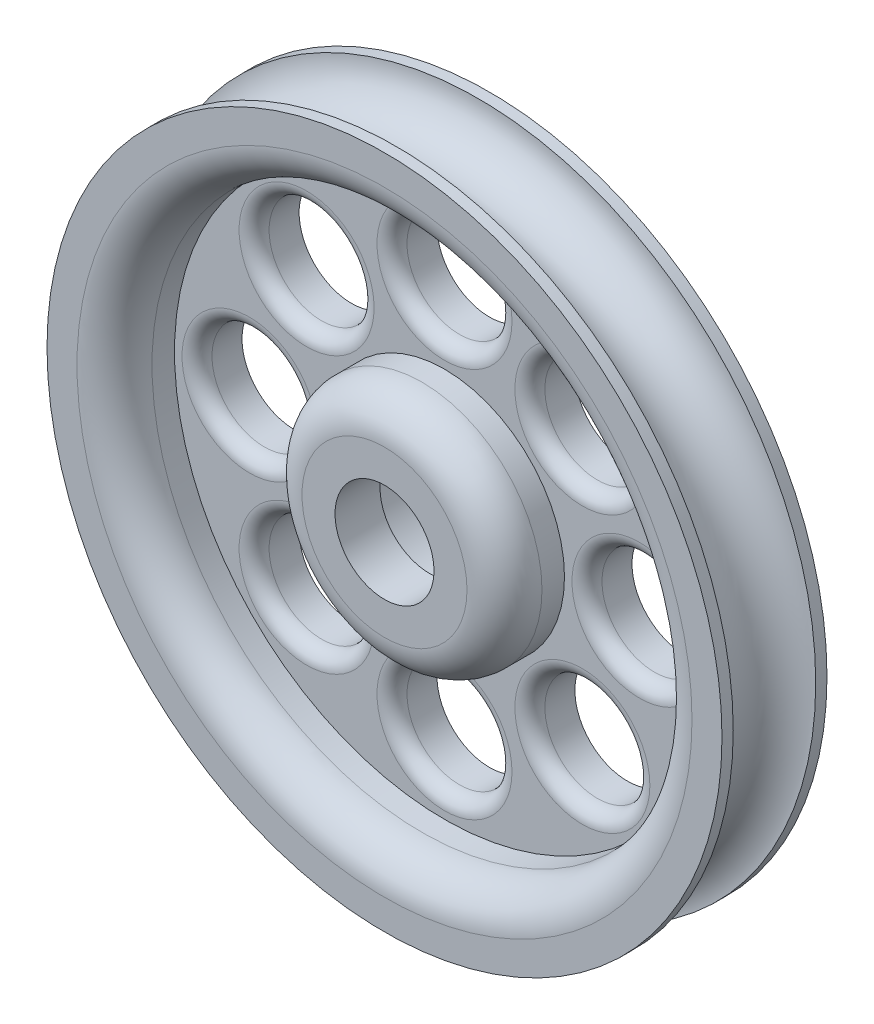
ISO-10303-21;
HEADER;
FILE_DESCRIPTION(('STEP AP214'),'2;1');
FILE_NAME('part.step','',(''),(''),'','','');
FILE_SCHEMA(('AUTOMOTIVE_DESIGN { 1 0 10303 214 1 1 1 1 }'));
ENDSEC;
DATA;
#1=APPLICATION_CONTEXT('core data for automotive mechanical design processes');
#2=APPLICATION_PROTOCOL_DEFINITION('international standard','automotive_design',2000,#1);
#3=PRODUCT_CONTEXT('',#1,'mechanical');
#4=PRODUCT('Part','Part','',(#3));
#5=PRODUCT_RELATED_PRODUCT_CATEGORY('part','',(#4));
#6=PRODUCT_DEFINITION_FORMATION('','',#4);
#7=PRODUCT_DEFINITION_CONTEXT('part definition',#1,'design');
#8=PRODUCT_DEFINITION('design','',#6,#7);
#9=PRODUCT_DEFINITION_SHAPE('','',#8);
#10=(LENGTH_UNIT() NAMED_UNIT(*) SI_UNIT(.MILLI.,.METRE.));
#11=(NAMED_UNIT(*) PLANE_ANGLE_UNIT() SI_UNIT($,.RADIAN.));
#12=(NAMED_UNIT(*) SI_UNIT($,.STERADIAN.) SOLID_ANGLE_UNIT());
#13=UNCERTAINTY_MEASURE_WITH_UNIT(LENGTH_MEASURE(1.E-05),#10,'distance_accuracy_value','');
#14=(GEOMETRIC_REPRESENTATION_CONTEXT(3) GLOBAL_UNCERTAINTY_ASSIGNED_CONTEXT((#13)) GLOBAL_UNIT_ASSIGNED_CONTEXT((#10,
#11,#12)) REPRESENTATION_CONTEXT('',''));
#15=CARTESIAN_POINT('',(0.,0.,0.));
#16=DIRECTION('',(0.,0.,1.));
#17=DIRECTION('',(1.,0.,0.));
#18=AXIS2_PLACEMENT_3D('',#15,#16,#17);
#19=CARTESIAN_POINT('',(0.,0.,7.));
#20=DIRECTION('',(0.,0.,-1.));
#21=DIRECTION('',(-1.,0.,0.));
#22=AXIS2_PLACEMENT_3D('',#19,#20,#21);
#23=CYLINDRICAL_SURFACE('',#22,22.5);
#24=CARTESIAN_POINT('',(0.,0.,0.750000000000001));
#25=DIRECTION('',(0.,0.,1.));
#26=DIRECTION('',(1.,0.,0.));
#27=AXIS2_PLACEMENT_3D('',#24,#25,#26);
#28=CIRCLE('',#27,22.5);
#29=CARTESIAN_POINT('',(22.5,0.,0.750000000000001));
#30=VERTEX_POINT('',#29);
#31=EDGE_CURVE('E99',#30,#30,#28,.F.);
#32=ORIENTED_EDGE('',*,*,#31,.T.);
#33=EDGE_LOOP('',(#32));
#34=FACE_BOUND('',#33,.T.);
#35=CARTESIAN_POINT('',(0.,0.,0.));
#36=DIRECTION('',(0.,0.,1.));
#37=DIRECTION('',(1.,0.,0.));
#38=AXIS2_PLACEMENT_3D('',#35,#36,#37);
#39=CIRCLE('',#38,22.5);
#40=CARTESIAN_POINT('',(22.5,0.,0.));
#41=VERTEX_POINT('',#40);
#42=EDGE_CURVE('E102',#41,#41,#39,.T.);
#43=ORIENTED_EDGE('',*,*,#42,.T.);
#44=EDGE_LOOP('',(#43));
#45=FACE_BOUND('',#44,.T.);
#46=ADVANCED_FACE('F30',(#34,#45),#23,.T.);
#47=CARTESIAN_POINT('',(0.,0.,0.));
#48=DIRECTION('',(0.,0.,1.));
#49=DIRECTION('',(1.,0.,0.));
#50=AXIS2_PLACEMENT_3D('',#47,#48,#49);
#51=PLANE('',#50);
#52=CARTESIAN_POINT('',(0.,0.,0.));
#53=DIRECTION('',(0.,0.,-1.));
#54=DIRECTION('',(-1.,0.,0.));
#55=AXIS2_PLACEMENT_3D('',#52,#53,#54);
#56=CIRCLE('',#55,4.95);
#57=CARTESIAN_POINT('',(-4.95,0.,0.));
#58=VERTEX_POINT('',#57);
#59=EDGE_CURVE('E141',#58,#58,#56,.T.);
#60=ORIENTED_EDGE('',*,*,#59,.F.);
#61=EDGE_LOOP('',(#60));
#62=FACE_BOUND('',#61,.T.);
#63=CARTESIAN_POINT('',(-9.1923881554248,9.19238815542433,0.));
#64=DIRECTION('',(0.,0.,1.));
#65=DIRECTION('',(1.,0.,0.));
#66=AXIS2_PLACEMENT_3D('',#63,#64,#65);
#67=CIRCLE('',#66,3.5000000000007);
#68=CARTESIAN_POINT('',(-5.6923881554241,9.19238815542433,0.));
#69=VERTEX_POINT('',#68);
#70=EDGE_CURVE('E137',#69,#69,#67,.T.);
#71=ORIENTED_EDGE('',*,*,#70,.T.);
#72=EDGE_LOOP('',(#71));
#73=FACE_BOUND('',#72,.T.);
#74=CARTESIAN_POINT('',(-12.9999999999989,-1.10844666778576E-12,0.));
#75=DIRECTION('',(0.,0.,1.));
#76=DIRECTION('',(1.,0.,0.));
#77=AXIS2_PLACEMENT_3D('',#74,#75,#76);
#78=CIRCLE('',#77,3.50000000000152);
#79=CARTESIAN_POINT('',(-9.49999999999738,-1.10844666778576E-12,0.));
#80=VERTEX_POINT('',#79);
#81=EDGE_CURVE('E134',#80,#80,#78,.T.);
#82=ORIENTED_EDGE('',*,*,#81,.T.);
#83=EDGE_LOOP('',(#82));
#84=FACE_BOUND('',#83,.T.);
#85=CARTESIAN_POINT('',(-9.19238815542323,-9.1923881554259,0.));
#86=DIRECTION('',(0.,0.,1.));
#87=DIRECTION('',(1.,0.,0.));
#88=AXIS2_PLACEMENT_3D('',#85,#86,#87);
#89=CIRCLE('',#88,3.50000000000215);
#90=CARTESIAN_POINT('',(-5.69238815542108,-9.1923881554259,0.));
#91=VERTEX_POINT('',#90);
#92=EDGE_CURVE('E131',#91,#91,#89,.T.);
#93=ORIENTED_EDGE('',*,*,#92,.T.);
#94=EDGE_LOOP('',(#93));
#95=FACE_BOUND('',#94,.T.);
#96=CARTESIAN_POINT('',(2.21370925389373E-12,-13.,0.));
#97=DIRECTION('',(0.,0.,1.));
#98=DIRECTION('',(1.,0.,0.));
#99=AXIS2_PLACEMENT_3D('',#96,#97,#98);
#100=CIRCLE('',#99,3.50000000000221);
#101=CARTESIAN_POINT('',(3.50000000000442,-13.,0.));
#102=VERTEX_POINT('',#101);
#103=EDGE_CURVE('E128',#102,#102,#100,.T.);
#104=ORIENTED_EDGE('',*,*,#103,.T.);
#105=EDGE_LOOP('',(#104));
#106=FACE_BOUND('',#105,.T.);
#107=CARTESIAN_POINT('',(9.19238815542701,-9.19238815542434,0.));
#108=DIRECTION('',(0.,0.,1.));
#109=DIRECTION('',(1.,0.,0.));
#110=AXIS2_PLACEMENT_3D('',#107,#108,#109);
#111=CIRCLE('',#110,3.50000000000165);
#112=CARTESIAN_POINT('',(12.6923881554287,-9.19238815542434,0.));
#113=VERTEX_POINT('',#112);
#114=EDGE_CURVE('E125',#113,#113,#111,.T.);
#115=ORIENTED_EDGE('',*,*,#114,.T.);
#116=EDGE_LOOP('',(#115));
#117=FACE_BOUND('',#116,.T.);
#118=CARTESIAN_POINT('',(13.0000000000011,1.10685462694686E-12,0.));
#119=DIRECTION('',(0.,0.,1.));
#120=DIRECTION('',(1.,0.,0.));
#121=AXIS2_PLACEMENT_3D('',#118,#119,#120);
#122=CIRCLE('',#121,3.50000000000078);
#123=CARTESIAN_POINT('',(16.5000000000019,1.10685462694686E-12,0.));
#124=VERTEX_POINT('',#123);
#125=EDGE_CURVE('E122',#124,#124,#122,.T.);
#126=ORIENTED_EDGE('',*,*,#125,.T.);
#127=EDGE_LOOP('',(#126));
#128=FACE_BOUND('',#127,.T.);
#129=CARTESIAN_POINT('',(9.19238815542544,9.1923881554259,0.));
#130=DIRECTION('',(0.,0.,1.));
#131=DIRECTION('',(1.,0.,0.));
#132=AXIS2_PLACEMENT_3D('',#129,#130,#131);
#133=CIRCLE('',#132,3.50000000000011);
#134=CARTESIAN_POINT('',(12.6923881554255,9.1923881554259,0.));
#135=VERTEX_POINT('',#134);
#136=EDGE_CURVE('E119',#135,#135,#133,.T.);
#137=ORIENTED_EDGE('',*,*,#136,.T.);
#138=EDGE_LOOP('',(#137));
#139=FACE_BOUND('',#138,.T.);
#140=CARTESIAN_POINT('',(0.,13.,0.));
#141=DIRECTION('',(0.,0.,1.));
#142=DIRECTION('',(1.,0.,0.));
#143=AXIS2_PLACEMENT_3D('',#140,#141,#142);
#144=CIRCLE('',#143,3.5);
#145=CARTESIAN_POINT('',(3.5,13.,0.));
#146=VERTEX_POINT('',#145);
#147=EDGE_CURVE('E116',#146,#146,#144,.T.);
#148=ORIENTED_EDGE('',*,*,#147,.T.);
#149=EDGE_LOOP('',(#148));
#150=FACE_BOUND('',#149,.T.);
#151=ORIENTED_EDGE('',*,*,#42,.F.);
#152=EDGE_LOOP('',(#151));
#153=FACE_BOUND('',#152,.T.);
#154=ADVANCED_FACE('F174',(#62,#73,#84,#95,#106,#117,#128,#139,#150,#153),#51,.F.);
#155=CARTESIAN_POINT('',(0.,0.,3.5));
#156=DIRECTION('',(0.,0.,-1.));
#157=DIRECTION('',(-1.,0.,0.));
#158=AXIS2_PLACEMENT_3D('',#155,#156,#157);
#159=TOROIDAL_SURFACE('',#158,22.5,2.75);
#160=CARTESIAN_POINT('',(0.,0.,6.25));
#161=DIRECTION('',(0.,0.,-1.));
#162=DIRECTION('',(-1.,0.,0.));
#163=AXIS2_PLACEMENT_3D('',#160,#161,#162);
#164=CIRCLE('',#163,22.5);
#165=CARTESIAN_POINT('',(-22.5,0.,6.25));
#166=VERTEX_POINT('',#165);
#167=EDGE_CURVE('E103',#166,#166,#164,.F.);
#168=ORIENTED_EDGE('',*,*,#167,.F.);
#169=EDGE_LOOP('',(#168));
#170=FACE_BOUND('',#169,.T.);
#171=ORIENTED_EDGE('',*,*,#31,.F.);
#172=EDGE_LOOP('',(#171));
#173=FACE_BOUND('',#172,.T.);
#174=ADVANCED_FACE('F177',(#170,#173),#159,.F.);
#175=CARTESIAN_POINT('',(0.,0.,7.));
#176=DIRECTION('',(0.,0.,1.));
#177=DIRECTION('',(1.,0.,0.));
#178=AXIS2_PLACEMENT_3D('',#175,#176,#177);
#179=PLANE('',#178);
#180=CARTESIAN_POINT('',(0.,0.,7.));
#181=DIRECTION('',(0.,0.,1.));
#182=DIRECTION('',(1.,0.,0.));
#183=AXIS2_PLACEMENT_3D('',#180,#181,#182);
#184=CIRCLE('',#183,20.5);
#185=CARTESIAN_POINT('',(20.5,0.,7.));
#186=VERTEX_POINT('',#185);
#187=EDGE_CURVE('E86',#186,#186,#184,.F.);
#188=ORIENTED_EDGE('',*,*,#187,.T.);
#189=EDGE_LOOP('',(#188));
#190=FACE_BOUND('',#189,.T.);
#191=CARTESIAN_POINT('',(0.,0.,7.));
#192=DIRECTION('',(0.,0.,1.));
#193=DIRECTION('',(1.,0.,0.));
#194=AXIS2_PLACEMENT_3D('',#191,#192,#193);
#195=CIRCLE('',#194,22.5);
#196=CARTESIAN_POINT('',(22.5,0.,7.));
#197=VERTEX_POINT('',#196);
#198=EDGE_CURVE('E98',#197,#197,#195,.T.);
#199=ORIENTED_EDGE('',*,*,#198,.T.);
#200=EDGE_LOOP('',(#199));
#201=FACE_BOUND('',#200,.T.);
#202=ADVANCED_FACE('F206',(#190,#201),#179,.T.);
#203=ORIENTED_EDGE('',*,*,#167,.T.);
#204=EDGE_LOOP('',(#203));
#205=FACE_BOUND('',#204,.T.);
#206=ORIENTED_EDGE('',*,*,#198,.F.);
#207=EDGE_LOOP('',(#206));
#208=FACE_BOUND('',#207,.T.);
#209=ADVANCED_FACE('F200',(#205,#208),#23,.T.);
#210=CARTESIAN_POINT('',(0.,0.,3.));
#211=DIRECTION('',(0.,0.,1.));
#212=DIRECTION('',(1.,0.,0.));
#213=AXIS2_PLACEMENT_3D('',#210,#211,#212);
#214=CYLINDRICAL_SURFACE('',#213,18.);
#215=CARTESIAN_POINT('',(0.,0.,4.5));
#216=DIRECTION('',(0.,0.,1.));
#217=DIRECTION('',(1.,0.,0.));
#218=AXIS2_PLACEMENT_3D('',#215,#216,#217);
#219=CIRCLE('',#218,18.);
#220=CARTESIAN_POINT('',(18.,0.,4.5));
#221=VERTEX_POINT('',#220);
#222=EDGE_CURVE('E89',#221,#221,#219,.T.);
#223=ORIENTED_EDGE('',*,*,#222,.T.);
#224=EDGE_LOOP('',(#223));
#225=FACE_BOUND('',#224,.T.);
#226=CARTESIAN_POINT('',(0.,0.,3.));
#227=DIRECTION('',(0.,0.,1.));
#228=DIRECTION('',(1.,0.,0.));
#229=AXIS2_PLACEMENT_3D('',#226,#227,#228);
#230=CIRCLE('',#229,18.);
#231=CARTESIAN_POINT('',(18.,0.,3.));
#232=VERTEX_POINT('',#231);
#233=EDGE_CURVE('E106',#232,#232,#230,.T.);
#234=ORIENTED_EDGE('',*,*,#233,.F.);
#235=EDGE_LOOP('',(#234));
#236=FACE_BOUND('',#235,.T.);
#237=ADVANCED_FACE('F205',(#225,#236),#214,.F.);
#238=CARTESIAN_POINT('',(0.,0.,3.));
#239=DIRECTION('',(0.,0.,1.));
#240=DIRECTION('',(1.,0.,0.));
#241=AXIS2_PLACEMENT_3D('',#238,#239,#240);
#242=PLANE('',#241);
#243=CARTESIAN_POINT('',(0.,13.,3.));
#244=DIRECTION('',(0.,0.,1.));
#245=DIRECTION('',(1.,0.,0.));
#246=AXIS2_PLACEMENT_3D('',#243,#244,#245);
#247=CIRCLE('',#246,4.5);
#248=CARTESIAN_POINT('',(4.5,13.,3.));
#249=VERTEX_POINT('',#248);
#250=EDGE_CURVE('E59',#249,#249,#247,.F.);
#251=ORIENTED_EDGE('',*,*,#250,.T.);
#252=EDGE_LOOP('',(#251));
#253=FACE_BOUND('',#252,.T.);
#254=CARTESIAN_POINT('',(-9.1923881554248,9.19238815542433,3.));
#255=DIRECTION('',(0.,0.,1.));
#256=DIRECTION('',(1.,0.,0.));
#257=AXIS2_PLACEMENT_3D('',#254,#255,#256);
#258=CIRCLE('',#257,4.5000000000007);
#259=CARTESIAN_POINT('',(-4.6923881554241,9.19238815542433,3.));
#260=VERTEX_POINT('',#259);
#261=EDGE_CURVE('E62',#260,#260,#258,.F.);
#262=ORIENTED_EDGE('',*,*,#261,.T.);
#263=EDGE_LOOP('',(#262));
#264=FACE_BOUND('',#263,.T.);
#265=CARTESIAN_POINT('',(-9.19238815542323,-9.1923881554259,3.));
#266=DIRECTION('',(0.,0.,1.));
#267=DIRECTION('',(1.,0.,0.));
#268=AXIS2_PLACEMENT_3D('',#265,#266,#267);
#269=CIRCLE('',#268,4.50000000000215);
#270=CARTESIAN_POINT('',(-4.69238815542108,-9.1923881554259,3.));
#271=VERTEX_POINT('',#270);
#272=EDGE_CURVE('E65',#271,#271,#269,.F.);
#273=ORIENTED_EDGE('',*,*,#272,.T.);
#274=EDGE_LOOP('',(#273));
#275=FACE_BOUND('',#274,.T.);
#276=CARTESIAN_POINT('',(-12.9999999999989,-1.10844666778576E-12,3.));
#277=DIRECTION('',(0.,0.,1.));
#278=DIRECTION('',(1.,0.,0.));
#279=AXIS2_PLACEMENT_3D('',#276,#277,#278);
#280=CIRCLE('',#279,4.50000000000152);
#281=CARTESIAN_POINT('',(-8.49999999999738,-1.10844666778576E-12,3.));
#282=VERTEX_POINT('',#281);
#283=EDGE_CURVE('E68',#282,#282,#280,.F.);
#284=ORIENTED_EDGE('',*,*,#283,.T.);
#285=EDGE_LOOP('',(#284));
#286=FACE_BOUND('',#285,.T.);
#287=CARTESIAN_POINT('',(2.21370925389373E-12,-13.,3.));
#288=DIRECTION('',(0.,0.,1.));
#289=DIRECTION('',(1.,0.,0.));
#290=AXIS2_PLACEMENT_3D('',#287,#288,#289);
#291=CIRCLE('',#290,4.50000000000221);
#292=CARTESIAN_POINT('',(4.50000000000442,-13.,3.));
#293=VERTEX_POINT('',#292);
#294=EDGE_CURVE('E71',#293,#293,#291,.F.);
#295=ORIENTED_EDGE('',*,*,#294,.T.);
#296=EDGE_LOOP('',(#295));
#297=FACE_BOUND('',#296,.T.);
#298=CARTESIAN_POINT('',(9.19238815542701,-9.19238815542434,3.));
#299=DIRECTION('',(0.,0.,1.));
#300=DIRECTION('',(1.,0.,0.));
#301=AXIS2_PLACEMENT_3D('',#298,#299,#300);
#302=CIRCLE('',#301,4.50000000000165);
#303=CARTESIAN_POINT('',(13.6923881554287,-9.19238815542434,3.));
#304=VERTEX_POINT('',#303);
#305=EDGE_CURVE('E74',#304,#304,#302,.F.);
#306=ORIENTED_EDGE('',*,*,#305,.T.);
#307=EDGE_LOOP('',(#306));
#308=FACE_BOUND('',#307,.T.);
#309=CARTESIAN_POINT('',(13.0000000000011,1.10685462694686E-12,3.));
#310=DIRECTION('',(0.,0.,1.));
#311=DIRECTION('',(1.,0.,0.));
#312=AXIS2_PLACEMENT_3D('',#309,#310,#311);
#313=CIRCLE('',#312,4.50000000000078);
#314=CARTESIAN_POINT('',(17.5000000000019,1.10685462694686E-12,3.));
#315=VERTEX_POINT('',#314);
#316=EDGE_CURVE('E77',#315,#315,#313,.F.);
#317=ORIENTED_EDGE('',*,*,#316,.T.);
#318=EDGE_LOOP('',(#317));
#319=FACE_BOUND('',#318,.T.);
#320=CARTESIAN_POINT('',(9.19238815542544,9.1923881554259,3.));
#321=DIRECTION('',(0.,0.,1.));
#322=DIRECTION('',(1.,0.,0.));
#323=AXIS2_PLACEMENT_3D('',#320,#321,#322);
#324=CIRCLE('',#323,4.50000000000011);
#325=CARTESIAN_POINT('',(13.6923881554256,9.1923881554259,3.));
#326=VERTEX_POINT('',#325);
#327=EDGE_CURVE('E80',#326,#326,#324,.F.);
#328=ORIENTED_EDGE('',*,*,#327,.T.);
#329=EDGE_LOOP('',(#328));
#330=FACE_BOUND('',#329,.T.);
#331=CARTESIAN_POINT('',(0.,0.,3.));
#332=DIRECTION('',(0.,0.,1.));
#333=DIRECTION('',(1.,0.,0.));
#334=AXIS2_PLACEMENT_3D('',#331,#332,#333);
#335=CIRCLE('',#334,8.);
#336=CARTESIAN_POINT('',(8.,0.,3.));
#337=VERTEX_POINT('',#336);
#338=EDGE_CURVE('E113',#337,#337,#335,.T.);
#339=ORIENTED_EDGE('',*,*,#338,.F.);
#340=EDGE_LOOP('',(#339));
#341=FACE_BOUND('',#340,.T.);
#342=ORIENTED_EDGE('',*,*,#233,.T.);
#343=EDGE_LOOP('',(#342));
#344=FACE_BOUND('',#343,.T.);
#345=ADVANCED_FACE('F212',(#253,#264,#275,#286,#297,#308,#319,#330,#341,#344),#242,.T.);
#346=CARTESIAN_POINT('',(0.,0.,3.));
#347=DIRECTION('',(0.,0.,1.));
#348=DIRECTION('',(1.,0.,0.));
#349=AXIS2_PLACEMENT_3D('',#346,#347,#348);
#350=CYLINDRICAL_SURFACE('',#349,8.);
#351=CARTESIAN_POINT('',(0.,0.,4.5));
#352=DIRECTION('',(0.,0.,1.));
#353=DIRECTION('',(1.,0.,0.));
#354=AXIS2_PLACEMENT_3D('',#351,#352,#353);
#355=CIRCLE('',#354,8.);
#356=CARTESIAN_POINT('',(8.,0.,4.5));
#357=VERTEX_POINT('',#356);
#358=EDGE_CURVE('E92',#357,#357,#355,.F.);
#359=ORIENTED_EDGE('',*,*,#358,.T.);
#360=EDGE_LOOP('',(#359));
#361=FACE_BOUND('',#360,.T.);
#362=ORIENTED_EDGE('',*,*,#338,.T.);
#363=EDGE_LOOP('',(#362));
#364=FACE_BOUND('',#363,.T.);
#365=ADVANCED_FACE('F231',(#361,#364),#350,.T.);
#366=CARTESIAN_POINT('',(0.,0.,7.));
#367=DIRECTION('',(0.,0.,-1.));
#368=DIRECTION('',(-1.,0.,0.));
#369=AXIS2_PLACEMENT_3D('',#366,#367,#368);
#370=CIRCLE('',#369,3.3);
#371=CARTESIAN_POINT('',(-3.3,0.,7.));
#372=VERTEX_POINT('',#371);
#373=EDGE_CURVE('E144',#372,#372,#370,.T.);
#374=ORIENTED_EDGE('',*,*,#373,.T.);
#375=EDGE_LOOP('',(#374));
#376=FACE_BOUND('',#375,.T.);
#377=CARTESIAN_POINT('',(0.,0.,7.));
#378=DIRECTION('',(0.,0.,1.));
#379=DIRECTION('',(1.,0.,0.));
#380=AXIS2_PLACEMENT_3D('',#377,#378,#379);
#381=CIRCLE('',#380,5.5);
#382=CARTESIAN_POINT('',(5.5,0.,7.));
#383=VERTEX_POINT('',#382);
#384=EDGE_CURVE('E95',#383,#383,#381,.T.);
#385=ORIENTED_EDGE('',*,*,#384,.T.);
#386=EDGE_LOOP('',(#385));
#387=FACE_BOUND('',#386,.T.);
#388=ADVANCED_FACE('F153',(#376,#387),#179,.T.);
#389=CARTESIAN_POINT('',(0.,13.,0.));
#390=DIRECTION('',(0.,0.,1.));
#391=DIRECTION('',(1.,0.,0.));
#392=AXIS2_PLACEMENT_3D('',#389,#390,#391);
#393=CYLINDRICAL_SURFACE('',#392,3.5);
#394=CARTESIAN_POINT('',(0.,13.,2.));
#395=DIRECTION('',(0.,0.,1.));
#396=DIRECTION('',(1.,0.,0.));
#397=AXIS2_PLACEMENT_3D('',#394,#395,#396);
#398=CIRCLE('',#397,3.5);
#399=CARTESIAN_POINT('',(3.5,13.,2.));
#400=VERTEX_POINT('',#399);
#401=EDGE_CURVE('E83',#400,#400,#398,.T.);
#402=ORIENTED_EDGE('',*,*,#401,.T.);
#403=EDGE_LOOP('',(#402));
#404=FACE_BOUND('',#403,.T.);
#405=ORIENTED_EDGE('',*,*,#147,.F.);
#406=EDGE_LOOP('',(#405));
#407=FACE_BOUND('',#406,.T.);
#408=ADVANCED_FACE('F236',(#404,#407),#393,.F.);
#409=CARTESIAN_POINT('',(9.19238815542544,9.1923881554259,0.));
#410=DIRECTION('',(0.,0.,1.));
#411=DIRECTION('',(1.,0.,0.));
#412=AXIS2_PLACEMENT_3D('',#409,#410,#411);
#413=CYLINDRICAL_SURFACE('',#412,3.50000000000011);
#414=CARTESIAN_POINT('',(9.19238815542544,9.1923881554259,2.));
#415=DIRECTION('',(0.,0.,1.));
#416=DIRECTION('',(1.,0.,0.));
#417=AXIS2_PLACEMENT_3D('',#414,#415,#416);
#418=CIRCLE('',#417,3.50000000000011);
#419=CARTESIAN_POINT('',(12.6923881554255,9.1923881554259,2.));
#420=VERTEX_POINT('',#419);
#421=EDGE_CURVE('E10',#420,#420,#418,.T.);
#422=ORIENTED_EDGE('',*,*,#421,.T.);
#423=EDGE_LOOP('',(#422));
#424=FACE_BOUND('',#423,.T.);
#425=ORIENTED_EDGE('',*,*,#136,.F.);
#426=EDGE_LOOP('',(#425));
#427=FACE_BOUND('',#426,.T.);
#428=ADVANCED_FACE('F239',(#424,#427),#413,.F.);
#429=CARTESIAN_POINT('',(13.0000000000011,1.10685462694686E-12,0.));
#430=DIRECTION('',(0.,0.,1.));
#431=DIRECTION('',(1.,0.,0.));
#432=AXIS2_PLACEMENT_3D('',#429,#430,#431);
#433=CYLINDRICAL_SURFACE('',#432,3.50000000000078);
#434=CARTESIAN_POINT('',(13.0000000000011,1.10685462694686E-12,2.));
#435=DIRECTION('',(0.,0.,1.));
#436=DIRECTION('',(1.,0.,0.));
#437=AXIS2_PLACEMENT_3D('',#434,#435,#436);
#438=CIRCLE('',#437,3.50000000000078);
#439=CARTESIAN_POINT('',(16.5000000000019,1.10685462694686E-12,2.));
#440=VERTEX_POINT('',#439);
#441=EDGE_CURVE('E37',#440,#440,#438,.T.);
#442=ORIENTED_EDGE('',*,*,#441,.T.);
#443=EDGE_LOOP('',(#442));
#444=FACE_BOUND('',#443,.T.);
#445=ORIENTED_EDGE('',*,*,#125,.F.);
#446=EDGE_LOOP('',(#445));
#447=FACE_BOUND('',#446,.T.);
#448=ADVANCED_FACE('F243',(#444,#447),#433,.F.);
#449=CARTESIAN_POINT('',(9.19238815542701,-9.19238815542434,0.));
#450=DIRECTION('',(0.,0.,1.));
#451=DIRECTION('',(1.,0.,0.));
#452=AXIS2_PLACEMENT_3D('',#449,#450,#451);
#453=CYLINDRICAL_SURFACE('',#452,3.50000000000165);
#454=CARTESIAN_POINT('',(9.19238815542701,-9.19238815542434,2.));
#455=DIRECTION('',(0.,0.,1.));
#456=DIRECTION('',(1.,0.,0.));
#457=AXIS2_PLACEMENT_3D('',#454,#455,#456);
#458=CIRCLE('',#457,3.50000000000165);
#459=CARTESIAN_POINT('',(12.6923881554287,-9.19238815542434,2.));
#460=VERTEX_POINT('',#459);
#461=EDGE_CURVE('E41',#460,#460,#458,.T.);
#462=ORIENTED_EDGE('',*,*,#461,.T.);
#463=EDGE_LOOP('',(#462));
#464=FACE_BOUND('',#463,.T.);
#465=ORIENTED_EDGE('',*,*,#114,.F.);
#466=EDGE_LOOP('',(#465));
#467=FACE_BOUND('',#466,.T.);
#468=ADVANCED_FACE('F246',(#464,#467),#453,.F.);
#469=CARTESIAN_POINT('',(2.21370925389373E-12,-13.,0.));
#470=DIRECTION('',(0.,0.,1.));
#471=DIRECTION('',(1.,0.,0.));
#472=AXIS2_PLACEMENT_3D('',#469,#470,#471);
#473=CYLINDRICAL_SURFACE('',#472,3.50000000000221);
#474=CARTESIAN_POINT('',(2.21370925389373E-12,-13.,2.));
#475=DIRECTION('',(0.,0.,1.));
#476=DIRECTION('',(1.,0.,0.));
#477=AXIS2_PLACEMENT_3D('',#474,#475,#476);
#478=CIRCLE('',#477,3.50000000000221);
#479=CARTESIAN_POINT('',(3.50000000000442,-13.,2.));
#480=VERTEX_POINT('',#479);
#481=EDGE_CURVE('E45',#480,#480,#478,.T.);
#482=ORIENTED_EDGE('',*,*,#481,.T.);
#483=EDGE_LOOP('',(#482));
#484=FACE_BOUND('',#483,.T.);
#485=ORIENTED_EDGE('',*,*,#103,.F.);
#486=EDGE_LOOP('',(#485));
#487=FACE_BOUND('',#486,.T.);
#488=ADVANCED_FACE('F249',(#484,#487),#473,.F.);
#489=CARTESIAN_POINT('',(-9.19238815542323,-9.1923881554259,0.));
#490=DIRECTION('',(0.,0.,1.));
#491=DIRECTION('',(1.,0.,0.));
#492=AXIS2_PLACEMENT_3D('',#489,#490,#491);
#493=CYLINDRICAL_SURFACE('',#492,3.50000000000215);
#494=CARTESIAN_POINT('',(-9.19238815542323,-9.1923881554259,2.));
#495=DIRECTION('',(0.,0.,1.));
#496=DIRECTION('',(1.,0.,0.));
#497=AXIS2_PLACEMENT_3D('',#494,#495,#496);
#498=CIRCLE('',#497,3.50000000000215);
#499=CARTESIAN_POINT('',(-5.69238815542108,-9.1923881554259,2.));
#500=VERTEX_POINT('',#499);
#501=EDGE_CURVE('E53',#500,#500,#498,.T.);
#502=ORIENTED_EDGE('',*,*,#501,.T.);
#503=EDGE_LOOP('',(#502));
#504=FACE_BOUND('',#503,.T.);
#505=ORIENTED_EDGE('',*,*,#92,.F.);
#506=EDGE_LOOP('',(#505));
#507=FACE_BOUND('',#506,.T.);
#508=ADVANCED_FACE('F253',(#504,#507),#493,.F.);
#509=CARTESIAN_POINT('',(-12.9999999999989,-1.10844666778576E-12,0.));
#510=DIRECTION('',(0.,0.,1.));
#511=DIRECTION('',(1.,0.,0.));
#512=AXIS2_PLACEMENT_3D('',#509,#510,#511);
#513=CYLINDRICAL_SURFACE('',#512,3.50000000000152);
#514=CARTESIAN_POINT('',(-12.9999999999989,-1.10844666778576E-12,2.));
#515=DIRECTION('',(0.,0.,1.));
#516=DIRECTION('',(1.,0.,0.));
#517=AXIS2_PLACEMENT_3D('',#514,#515,#516);
#518=CIRCLE('',#517,3.50000000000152);
#519=CARTESIAN_POINT('',(-9.49999999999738,-1.10844666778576E-12,2.));
#520=VERTEX_POINT('',#519);
#521=EDGE_CURVE('E50',#520,#520,#518,.T.);
#522=ORIENTED_EDGE('',*,*,#521,.T.);
#523=EDGE_LOOP('',(#522));
#524=FACE_BOUND('',#523,.T.);
#525=ORIENTED_EDGE('',*,*,#81,.F.);
#526=EDGE_LOOP('',(#525));
#527=FACE_BOUND('',#526,.T.);
#528=ADVANCED_FACE('F257',(#524,#527),#513,.F.);
#529=CARTESIAN_POINT('',(-9.1923881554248,9.19238815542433,0.));
#530=DIRECTION('',(0.,0.,1.));
#531=DIRECTION('',(1.,0.,0.));
#532=AXIS2_PLACEMENT_3D('',#529,#530,#531);
#533=CYLINDRICAL_SURFACE('',#532,3.5000000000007);
#534=CARTESIAN_POINT('',(-9.1923881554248,9.19238815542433,2.));
#535=DIRECTION('',(0.,0.,1.));
#536=DIRECTION('',(1.,0.,0.));
#537=AXIS2_PLACEMENT_3D('',#534,#535,#536);
#538=CIRCLE('',#537,3.5000000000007);
#539=CARTESIAN_POINT('',(-5.6923881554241,9.19238815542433,2.));
#540=VERTEX_POINT('',#539);
#541=EDGE_CURVE('E56',#540,#540,#538,.T.);
#542=ORIENTED_EDGE('',*,*,#541,.T.);
#543=EDGE_LOOP('',(#542));
#544=FACE_BOUND('',#543,.T.);
#545=ORIENTED_EDGE('',*,*,#70,.F.);
#546=EDGE_LOOP('',(#545));
#547=FACE_BOUND('',#546,.T.);
#548=ADVANCED_FACE('F261',(#544,#547),#533,.F.);
#549=CARTESIAN_POINT('',(0.,0.,4.5));
#550=DIRECTION('',(0.,0.,1.));
#551=DIRECTION('',(1.,0.,0.));
#552=AXIS2_PLACEMENT_3D('',#549,#550,#551);
#553=TOROIDAL_SURFACE('',#552,5.5,2.5);
#554=ORIENTED_EDGE('',*,*,#358,.F.);
#555=EDGE_LOOP('',(#554));
#556=FACE_BOUND('',#555,.T.);
#557=ORIENTED_EDGE('',*,*,#384,.F.);
#558=EDGE_LOOP('',(#557));
#559=FACE_BOUND('',#558,.T.);
#560=ADVANCED_FACE('F264',(#556,#559),#553,.T.);
#561=CARTESIAN_POINT('',(0.,0.,4.5));
#562=DIRECTION('',(0.,0.,1.));
#563=DIRECTION('',(1.,0.,0.));
#564=AXIS2_PLACEMENT_3D('',#561,#562,#563);
#565=TOROIDAL_SURFACE('',#564,20.5,2.5);
#566=ORIENTED_EDGE('',*,*,#187,.F.);
#567=EDGE_LOOP('',(#566));
#568=FACE_BOUND('',#567,.T.);
#569=ORIENTED_EDGE('',*,*,#222,.F.);
#570=EDGE_LOOP('',(#569));
#571=FACE_BOUND('',#570,.T.);
#572=ADVANCED_FACE('F269',(#568,#571),#565,.T.);
#573=CARTESIAN_POINT('',(0.,13.,2.));
#574=DIRECTION('',(0.,0.,1.));
#575=DIRECTION('',(1.,0.,0.));
#576=AXIS2_PLACEMENT_3D('',#573,#574,#575);
#577=TOROIDAL_SURFACE('',#576,4.5,1.);
#578=ORIENTED_EDGE('',*,*,#250,.F.);
#579=EDGE_LOOP('',(#578));
#580=FACE_BOUND('',#579,.T.);
#581=ORIENTED_EDGE('',*,*,#401,.F.);
#582=EDGE_LOOP('',(#581));
#583=FACE_BOUND('',#582,.T.);
#584=ADVANCED_FACE('F277',(#580,#583),#577,.T.);
#585=CARTESIAN_POINT('',(-9.1923881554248,9.19238815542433,2.));
#586=DIRECTION('',(0.,0.,1.));
#587=DIRECTION('',(1.,0.,0.));
#588=AXIS2_PLACEMENT_3D('',#585,#586,#587);
#589=TOROIDAL_SURFACE('',#588,4.5000000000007,1.);
#590=ORIENTED_EDGE('',*,*,#261,.F.);
#591=EDGE_LOOP('',(#590));
#592=FACE_BOUND('',#591,.T.);
#593=ORIENTED_EDGE('',*,*,#541,.F.);
#594=EDGE_LOOP('',(#593));
#595=FACE_BOUND('',#594,.T.);
#596=ADVANCED_FACE('F274',(#592,#595),#589,.T.);
#597=CARTESIAN_POINT('',(-9.19238815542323,-9.1923881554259,2.));
#598=DIRECTION('',(0.,0.,1.));
#599=DIRECTION('',(1.,0.,0.));
#600=AXIS2_PLACEMENT_3D('',#597,#598,#599);
#601=TOROIDAL_SURFACE('',#600,4.50000000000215,1.);
#602=ORIENTED_EDGE('',*,*,#272,.F.);
#603=EDGE_LOOP('',(#602));
#604=FACE_BOUND('',#603,.T.);
#605=ORIENTED_EDGE('',*,*,#501,.F.);
#606=EDGE_LOOP('',(#605));
#607=FACE_BOUND('',#606,.T.);
#608=ADVANCED_FACE('F276',(#604,#607),#601,.T.);
#609=CARTESIAN_POINT('',(-12.9999999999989,-1.10844666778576E-12,2.));
#610=DIRECTION('',(0.,0.,1.));
#611=DIRECTION('',(1.,0.,0.));
#612=AXIS2_PLACEMENT_3D('',#609,#610,#611);
#613=TOROIDAL_SURFACE('',#612,4.50000000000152,1.);
#614=ORIENTED_EDGE('',*,*,#283,.F.);
#615=EDGE_LOOP('',(#614));
#616=FACE_BOUND('',#615,.T.);
#617=ORIENTED_EDGE('',*,*,#521,.F.);
#618=EDGE_LOOP('',(#617));
#619=FACE_BOUND('',#618,.T.);
#620=ADVANCED_FACE('F284',(#616,#619),#613,.T.);
#621=CARTESIAN_POINT('',(2.21370925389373E-12,-13.,2.));
#622=DIRECTION('',(0.,0.,1.));
#623=DIRECTION('',(1.,0.,0.));
#624=AXIS2_PLACEMENT_3D('',#621,#622,#623);
#625=TOROIDAL_SURFACE('',#624,4.50000000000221,1.);
#626=ORIENTED_EDGE('',*,*,#294,.F.);
#627=EDGE_LOOP('',(#626));
#628=FACE_BOUND('',#627,.T.);
#629=ORIENTED_EDGE('',*,*,#481,.F.);
#630=EDGE_LOOP('',(#629));
#631=FACE_BOUND('',#630,.T.);
#632=ADVANCED_FACE('F294',(#628,#631),#625,.T.);
#633=CARTESIAN_POINT('',(9.19238815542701,-9.19238815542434,2.));
#634=DIRECTION('',(0.,0.,1.));
#635=DIRECTION('',(1.,0.,0.));
#636=AXIS2_PLACEMENT_3D('',#633,#634,#635);
#637=TOROIDAL_SURFACE('',#636,4.50000000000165,1.);
#638=ORIENTED_EDGE('',*,*,#305,.F.);
#639=EDGE_LOOP('',(#638));
#640=FACE_BOUND('',#639,.T.);
#641=ORIENTED_EDGE('',*,*,#461,.F.);
#642=EDGE_LOOP('',(#641));
#643=FACE_BOUND('',#642,.T.);
#644=ADVANCED_FACE('F298',(#640,#643),#637,.T.);
#645=CARTESIAN_POINT('',(13.0000000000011,1.10685462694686E-12,2.));
#646=DIRECTION('',(0.,0.,1.));
#647=DIRECTION('',(1.,0.,0.));
#648=AXIS2_PLACEMENT_3D('',#645,#646,#647);
#649=TOROIDAL_SURFACE('',#648,4.50000000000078,1.);
#650=ORIENTED_EDGE('',*,*,#316,.F.);
#651=EDGE_LOOP('',(#650));
#652=FACE_BOUND('',#651,.T.);
#653=ORIENTED_EDGE('',*,*,#441,.F.);
#654=EDGE_LOOP('',(#653));
#655=FACE_BOUND('',#654,.T.);
#656=ADVANCED_FACE('F301',(#652,#655),#649,.T.);
#657=CARTESIAN_POINT('',(9.19238815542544,9.1923881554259,2.));
#658=DIRECTION('',(0.,0.,1.));
#659=DIRECTION('',(1.,0.,0.));
#660=AXIS2_PLACEMENT_3D('',#657,#658,#659);
#661=TOROIDAL_SURFACE('',#660,4.50000000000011,1.);
#662=ORIENTED_EDGE('',*,*,#327,.F.);
#663=EDGE_LOOP('',(#662));
#664=FACE_BOUND('',#663,.T.);
#665=ORIENTED_EDGE('',*,*,#421,.F.);
#666=EDGE_LOOP('',(#665));
#667=FACE_BOUND('',#666,.T.);
#668=ADVANCED_FACE('F32',(#664,#667),#661,.T.);
#669=CARTESIAN_POINT('',(0.,0.,4.));
#670=DIRECTION('',(0.,0.,-1.));
#671=DIRECTION('',(-1.,0.,0.));
#672=AXIS2_PLACEMENT_3D('',#669,#670,#671);
#673=CYLINDRICAL_SURFACE('',#672,4.95);
#674=CARTESIAN_POINT('',(0.,0.,4.));
#675=DIRECTION('',(0.,0.,-1.));
#676=DIRECTION('',(-1.,0.,0.));
#677=AXIS2_PLACEMENT_3D('',#674,#675,#676);
#678=CIRCLE('',#677,4.95);
#679=CARTESIAN_POINT('',(-4.95,0.,4.));
#680=VERTEX_POINT('',#679);
#681=EDGE_CURVE('E140',#680,#680,#678,.T.);
#682=ORIENTED_EDGE('',*,*,#681,.F.);
#683=EDGE_LOOP('',(#682));
#684=FACE_BOUND('',#683,.T.);
#685=ORIENTED_EDGE('',*,*,#59,.T.);
#686=EDGE_LOOP('',(#685));
#687=FACE_BOUND('',#686,.T.);
#688=ADVANCED_FACE('F165',(#684,#687),#673,.F.);
#689=CARTESIAN_POINT('',(0.,0.,4.));
#690=DIRECTION('',(0.,0.,-1.));
#691=DIRECTION('',(-1.,0.,0.));
#692=AXIS2_PLACEMENT_3D('',#689,#690,#691);
#693=PLANE('',#692);
#694=CARTESIAN_POINT('',(0.,0.,4.));
#695=DIRECTION('',(0.,0.,-1.));
#696=DIRECTION('',(-1.,0.,0.));
#697=AXIS2_PLACEMENT_3D('',#694,#695,#696);
#698=CIRCLE('',#697,3.3);
#699=CARTESIAN_POINT('',(-3.3,0.,4.));
#700=VERTEX_POINT('',#699);
#701=EDGE_CURVE('E147',#700,#700,#698,.T.);
#702=ORIENTED_EDGE('',*,*,#701,.F.);
#703=EDGE_LOOP('',(#702));
#704=FACE_BOUND('',#703,.T.);
#705=ORIENTED_EDGE('',*,*,#681,.T.);
#706=EDGE_LOOP('',(#705));
#707=FACE_BOUND('',#706,.T.);
#708=ADVANCED_FACE('F159',(#704,#707),#693,.T.);
#709=CARTESIAN_POINT('',(0.,0.,7.));
#710=DIRECTION('',(0.,0.,-1.));
#711=DIRECTION('',(-1.,0.,0.));
#712=AXIS2_PLACEMENT_3D('',#709,#710,#711);
#713=CYLINDRICAL_SURFACE('',#712,3.3);
#714=ORIENTED_EDGE('',*,*,#373,.F.);
#715=EDGE_LOOP('',(#714));
#716=FACE_BOUND('',#715,.T.);
#717=ORIENTED_EDGE('',*,*,#701,.T.);
#718=EDGE_LOOP('',(#717));
#719=FACE_BOUND('',#718,.T.);
#720=ADVANCED_FACE('F156',(#716,#719),#713,.F.);
#721=CLOSED_SHELL('',(#46,#154,#174,#202,#209,#237,#345,#365,#388,#408,#428,#448,#468,#488,#508,
#528,#548,#560,#572,#584,#596,#608,#620,#632,#644,#656,#668,#688,#708,#720));
#722=MANIFOLD_SOLID_BREP('B2',#721);
#723=ADVANCED_BREP_SHAPE_REPRESENTATION('',(#18,#722),#14);
#724=SHAPE_DEFINITION_REPRESENTATION(#9,#723);
ENDSEC;
END-ISO-10303-21;
